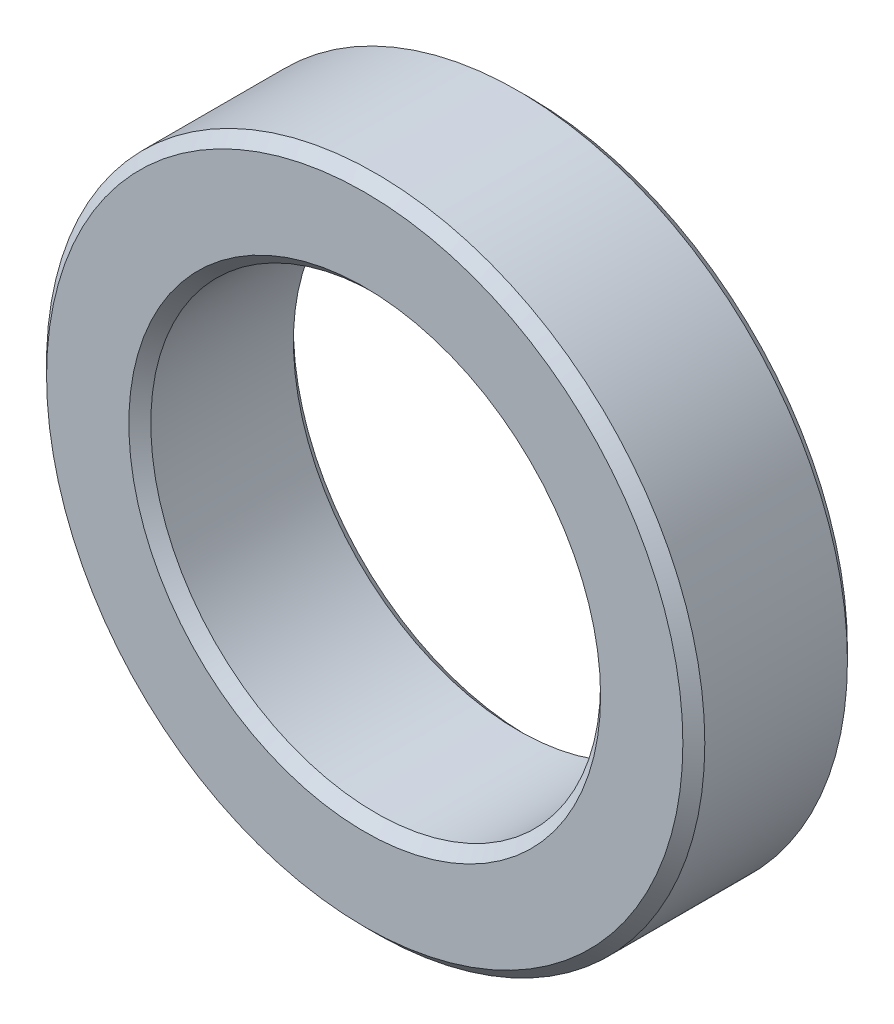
ISO-10303-21;
HEADER;
FILE_DESCRIPTION(('STEP AP214'),'2;1');
FILE_NAME('part.step','',(''),(''),'','','');
FILE_SCHEMA(('AUTOMOTIVE_DESIGN { 1 0 10303 214 1 1 1 1 }'));
ENDSEC;
DATA;
#1=APPLICATION_CONTEXT('core data for automotive mechanical design processes');
#2=APPLICATION_PROTOCOL_DEFINITION('international standard','automotive_design',2000,#1);
#3=PRODUCT_CONTEXT('',#1,'mechanical');
#4=PRODUCT('Part','Part','',(#3));
#5=PRODUCT_RELATED_PRODUCT_CATEGORY('part','',(#4));
#6=PRODUCT_DEFINITION_FORMATION('','',#4);
#7=PRODUCT_DEFINITION_CONTEXT('part definition',#1,'design');
#8=PRODUCT_DEFINITION('design','',#6,#7);
#9=PRODUCT_DEFINITION_SHAPE('','',#8);
#10=(LENGTH_UNIT() NAMED_UNIT(*) SI_UNIT(.MILLI.,.METRE.));
#11=(NAMED_UNIT(*) PLANE_ANGLE_UNIT() SI_UNIT($,.RADIAN.));
#12=(NAMED_UNIT(*) SI_UNIT($,.STERADIAN.) SOLID_ANGLE_UNIT());
#13=UNCERTAINTY_MEASURE_WITH_UNIT(LENGTH_MEASURE(1.E-05),#10,'distance_accuracy_value','');
#14=(GEOMETRIC_REPRESENTATION_CONTEXT(3) GLOBAL_UNCERTAINTY_ASSIGNED_CONTEXT((#13)) GLOBAL_UNIT_ASSIGNED_CONTEXT((#10,
#11,#12)) REPRESENTATION_CONTEXT('',''));
#15=CARTESIAN_POINT('',(0.,0.,0.));
#16=DIRECTION('',(0.,0.,1.));
#17=DIRECTION('',(1.,0.,0.));
#18=AXIS2_PLACEMENT_3D('',#15,#16,#17);
#19=CARTESIAN_POINT('',(0.,0.,1.5));
#20=DIRECTION('',(0.,0.,1.));
#21=DIRECTION('',(1.,0.,0.));
#22=AXIS2_PLACEMENT_3D('',#19,#20,#21);
#23=PLANE('',#22);
#24=CARTESIAN_POINT('',(0.,0.,1.5));
#25=DIRECTION('',(0.,0.,1.));
#26=DIRECTION('',(1.,0.,0.));
#27=AXIS2_PLACEMENT_3D('',#24,#25,#26);
#28=CIRCLE('',#27,4.3);
#29=CARTESIAN_POINT('',(4.3,0.,1.5));
#30=VERTEX_POINT('',#29);
#31=EDGE_CURVE('E10',#30,#30,#28,.F.);
#32=ORIENTED_EDGE('',*,*,#31,.T.);
#33=EDGE_LOOP('',(#32));
#34=FACE_BOUND('',#33,.T.);
#35=CARTESIAN_POINT('',(0.,0.,1.5));
#36=DIRECTION('',(0.,0.,1.));
#37=DIRECTION('',(1.,0.,0.));
#38=AXIS2_PLACEMENT_3D('',#35,#36,#37);
#39=CIRCLE('',#38,5.8);
#40=CARTESIAN_POINT('',(5.8,0.,1.5));
#41=VERTEX_POINT('',#40);
#42=EDGE_CURVE('E45',#41,#41,#39,.T.);
#43=ORIENTED_EDGE('',*,*,#42,.T.);
#44=EDGE_LOOP('',(#43));
#45=FACE_BOUND('',#44,.T.);
#46=ADVANCED_FACE('F37',(#34,#45),#23,.T.);
#47=CARTESIAN_POINT('',(0.,0.,-1.5));
#48=DIRECTION('',(0.,0.,1.));
#49=DIRECTION('',(1.,0.,0.));
#50=AXIS2_PLACEMENT_3D('',#47,#48,#49);
#51=PLANE('',#50);
#52=CARTESIAN_POINT('',(0.,0.,-1.5));
#53=DIRECTION('',(0.,0.,1.));
#54=DIRECTION('',(1.,0.,0.));
#55=AXIS2_PLACEMENT_3D('',#52,#53,#54);
#56=CIRCLE('',#55,5.8);
#57=CARTESIAN_POINT('',(5.8,0.,-1.5));
#58=VERTEX_POINT('',#57);
#59=EDGE_CURVE('E62',#58,#58,#56,.F.);
#60=ORIENTED_EDGE('',*,*,#59,.T.);
#61=EDGE_LOOP('',(#60));
#62=FACE_BOUND('',#61,.T.);
#63=CARTESIAN_POINT('',(0.,0.,-1.5));
#64=DIRECTION('',(0.,0.,1.));
#65=DIRECTION('',(1.,0.,0.));
#66=AXIS2_PLACEMENT_3D('',#63,#64,#65);
#67=CIRCLE('',#66,4.3);
#68=CARTESIAN_POINT('',(4.3,0.,-1.5));
#69=VERTEX_POINT('',#68);
#70=EDGE_CURVE('E66',#69,#69,#67,.T.);
#71=ORIENTED_EDGE('',*,*,#70,.T.);
#72=EDGE_LOOP('',(#71));
#73=FACE_BOUND('',#72,.T.);
#74=ADVANCED_FACE('F89',(#62,#73),#51,.F.);
#75=CARTESIAN_POINT('',(0.,0.,1.5));
#76=DIRECTION('',(0.,0.,-1.));
#77=DIRECTION('',(-1.,0.,0.));
#78=AXIS2_PLACEMENT_3D('',#75,#76,#77);
#79=CYLINDRICAL_SURFACE('',#78,6.);
#80=CARTESIAN_POINT('',(0.,0.,-1.3));
#81=DIRECTION('',(0.,0.,1.));
#82=DIRECTION('',(1.,0.,0.));
#83=AXIS2_PLACEMENT_3D('',#80,#81,#82);
#84=CIRCLE('',#83,6.);
#85=CARTESIAN_POINT('',(6.,0.,-1.3));
#86=VERTEX_POINT('',#85);
#87=EDGE_CURVE('E70',#86,#86,#84,.T.);
#88=ORIENTED_EDGE('',*,*,#87,.T.);
#89=EDGE_LOOP('',(#88));
#90=FACE_BOUND('',#89,.T.);
#91=CARTESIAN_POINT('',(0.,0.,1.3));
#92=DIRECTION('',(0.,0.,1.));
#93=DIRECTION('',(1.,0.,0.));
#94=AXIS2_PLACEMENT_3D('',#91,#92,#93);
#95=CIRCLE('',#94,6.);
#96=CARTESIAN_POINT('',(6.,0.,1.3));
#97=VERTEX_POINT('',#96);
#98=EDGE_CURVE('E73',#97,#97,#95,.F.);
#99=ORIENTED_EDGE('',*,*,#98,.T.);
#100=EDGE_LOOP('',(#99));
#101=FACE_BOUND('',#100,.T.);
#102=ADVANCED_FACE('F78',(#90,#101),#79,.T.);
#103=CARTESIAN_POINT('',(0.,0.,1.5));
#104=DIRECTION('',(0.,0.,-1.));
#105=DIRECTION('',(-1.,0.,0.));
#106=AXIS2_PLACEMENT_3D('',#103,#104,#105);
#107=CYLINDRICAL_SURFACE('',#106,4.1);
#108=CARTESIAN_POINT('',(0.,0.,-1.3));
#109=DIRECTION('',(0.,0.,1.));
#110=DIRECTION('',(1.,0.,0.));
#111=AXIS2_PLACEMENT_3D('',#108,#109,#110);
#112=CIRCLE('',#111,4.1);
#113=CARTESIAN_POINT('',(4.1,0.,-1.3));
#114=VERTEX_POINT('',#113);
#115=EDGE_CURVE('E51',#114,#114,#112,.F.);
#116=ORIENTED_EDGE('',*,*,#115,.T.);
#117=EDGE_LOOP('',(#116));
#118=FACE_BOUND('',#117,.T.);
#119=CARTESIAN_POINT('',(0.,0.,1.3));
#120=DIRECTION('',(0.,0.,1.));
#121=DIRECTION('',(1.,0.,0.));
#122=AXIS2_PLACEMENT_3D('',#119,#120,#121);
#123=CIRCLE('',#122,4.1);
#124=CARTESIAN_POINT('',(4.1,0.,1.3));
#125=VERTEX_POINT('',#124);
#126=EDGE_CURVE('E56',#125,#125,#123,.T.);
#127=ORIENTED_EDGE('',*,*,#126,.T.);
#128=EDGE_LOOP('',(#127));
#129=FACE_BOUND('',#128,.T.);
#130=ADVANCED_FACE('F97',(#118,#129),#107,.F.);
#131=CARTESIAN_POINT('',(0.,0.,-1.3));
#132=DIRECTION('',(0.,0.,1.));
#133=DIRECTION('',(1.,0.,0.));
#134=AXIS2_PLACEMENT_3D('',#131,#132,#133);
#135=CONICAL_SURFACE('',#134,6.,0.78539816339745);
#136=ORIENTED_EDGE('',*,*,#59,.F.);
#137=EDGE_LOOP('',(#136));
#138=FACE_BOUND('',#137,.T.);
#139=ORIENTED_EDGE('',*,*,#87,.F.);
#140=EDGE_LOOP('',(#139));
#141=FACE_BOUND('',#140,.T.);
#142=ADVANCED_FACE('F102',(#138,#141),#135,.T.);
#143=CARTESIAN_POINT('',(0.,0.,-1.5));
#144=DIRECTION('',(0.,0.,-1.));
#145=DIRECTION('',(-1.,0.,0.));
#146=AXIS2_PLACEMENT_3D('',#143,#144,#145);
#147=CONICAL_SURFACE('',#146,4.3,0.785398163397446);
#148=ORIENTED_EDGE('',*,*,#115,.F.);
#149=EDGE_LOOP('',(#148));
#150=FACE_BOUND('',#149,.T.);
#151=ORIENTED_EDGE('',*,*,#70,.F.);
#152=EDGE_LOOP('',(#151));
#153=FACE_BOUND('',#152,.T.);
#154=ADVANCED_FACE('F86',(#150,#153),#147,.F.);
#155=CARTESIAN_POINT('',(0.,0.,1.3));
#156=DIRECTION('',(0.,0.,1.));
#157=DIRECTION('',(1.,0.,0.));
#158=AXIS2_PLACEMENT_3D('',#155,#156,#157);
#159=CONICAL_SURFACE('',#158,4.1,0.78539816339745);
#160=ORIENTED_EDGE('',*,*,#31,.F.);
#161=EDGE_LOOP('',(#160));
#162=FACE_BOUND('',#161,.T.);
#163=ORIENTED_EDGE('',*,*,#126,.F.);
#164=EDGE_LOOP('',(#163));
#165=FACE_BOUND('',#164,.T.);
#166=ADVANCED_FACE('F82',(#162,#165),#159,.F.);
#167=CARTESIAN_POINT('',(0.,0.,1.5));
#168=DIRECTION('',(0.,0.,-1.));
#169=DIRECTION('',(-1.,0.,0.));
#170=AXIS2_PLACEMENT_3D('',#167,#168,#169);
#171=CONICAL_SURFACE('',#170,5.8,0.785398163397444);
#172=ORIENTED_EDGE('',*,*,#98,.F.);
#173=EDGE_LOOP('',(#172));
#174=FACE_BOUND('',#173,.T.);
#175=ORIENTED_EDGE('',*,*,#42,.F.);
#176=EDGE_LOOP('',(#175));
#177=FACE_BOUND('',#176,.T.);
#178=ADVANCED_FACE('F39',(#174,#177),#171,.T.);
#179=CLOSED_SHELL('',(#46,#74,#102,#130,#142,#154,#166,#178));
#180=MANIFOLD_SOLID_BREP('B2',#179);
#181=ADVANCED_BREP_SHAPE_REPRESENTATION('',(#18,#180),#14);
#182=SHAPE_DEFINITION_REPRESENTATION(#9,#181);
ENDSEC;
END-ISO-10303-21;
